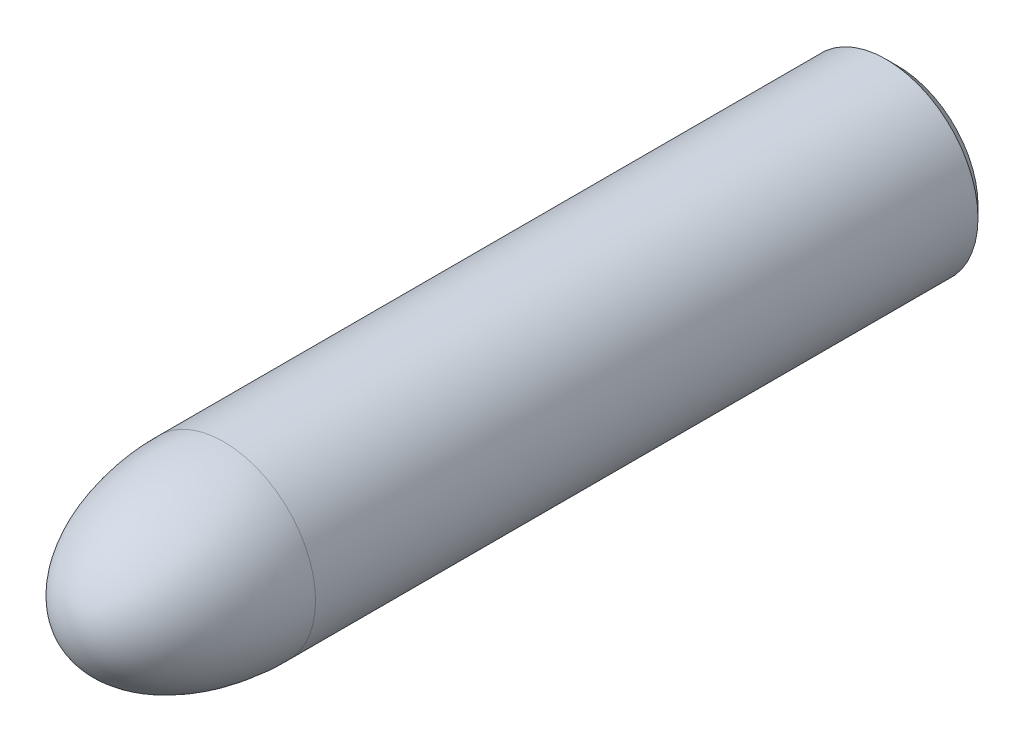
from build123d import *

# Parameters (mm, degrees)
CHAMFER_1_SIZE = 0.25


with BuildPart() as part:
    # Sketch 1 → Revolve 1 (revolve)
    with BuildSketch(Plane(origin=(0, 0, 0), x_dir=(0, 0, -1), z_dir=(1, 0, 0)), mode=Mode.PRIVATE) as revolve_1_sk:
        with BuildLine():
            Line((3.3175, 2), (18, 2))
            Line((18, 2), (18, 0))
            Line((18, 0), (0, 0))
            add(Edge.make_bspline(
                [(3.3175, 2), (0, 2), (0, 0)],
                knots=[1.570796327, 1.570796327, 1.570796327, 3.141592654, 3.141592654, 3.141592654], degree=2, weights=[1, 0.707106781, 1]))
        make_face()
    revolve(revolve_1_sk.sketch.rotate(Axis((0, 0, 0), (0, 0, -1)), 90), axis=Axis((0, 0, 0), (0, 0, -1)))

    # Chamfer 1
    chamfer_1_edges = [part.edges().sort_by_distance(p)[0] for p in [
        (-2, 0, -18),
    ]]
    chamfer(chamfer_1_edges, length=CHAMFER_1_SIZE)


solid = part.part
